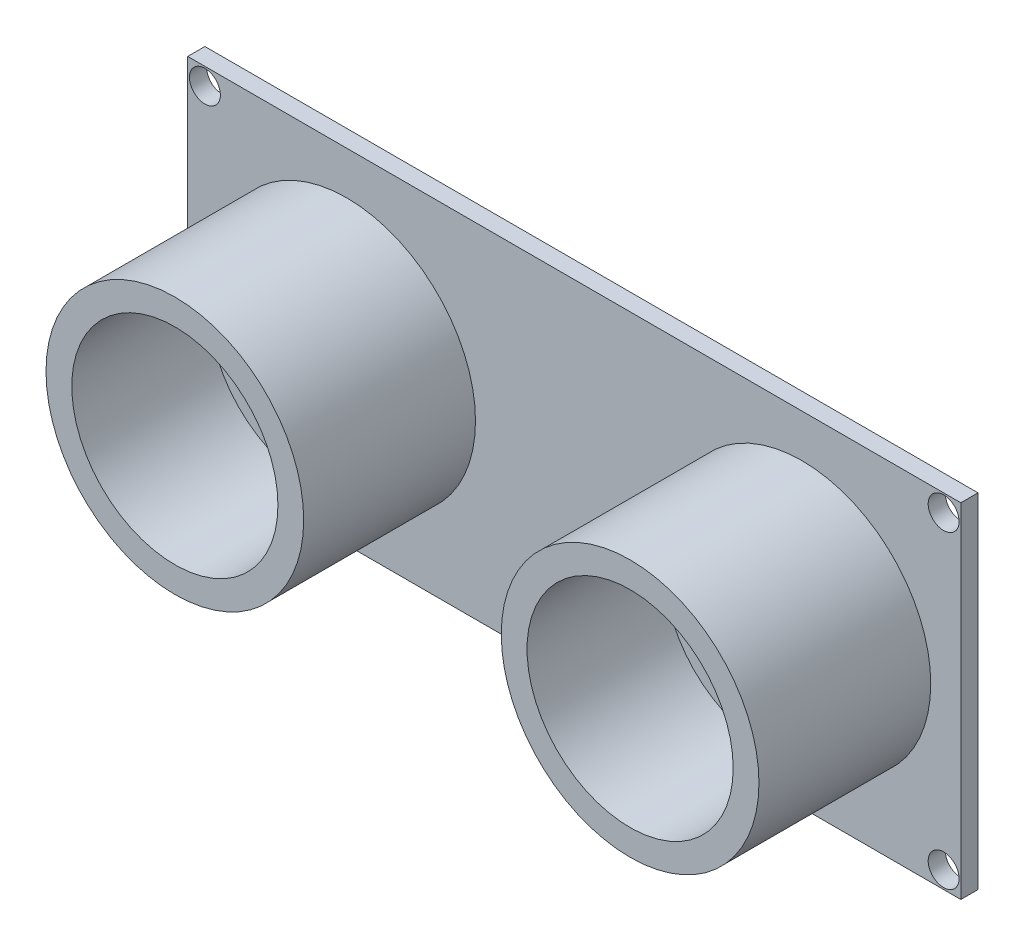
from build123d import *

# Parameters (mm, degrees)
SCHIZZO1_W                   = 45
SCHIZZO1_H                   = 20
ESTRUSIONE_ESTRUSIONE1_DEPTH = 1
FORO_PER_VITE_M1_6_1_D       = 1.8
SCHIZZO4_R                   = 7.5
ESTRUSIONE_ESTRUSIONE2_DEPTH = 10
SCHIZZO5_R                   = 6
TAGLIO_ESTRUSIONE1_DEPTH     = 8
SCHIZZO6_W                   = 0.5
SCHIZZO6_H                   = 7
ESTRUSIONE_ESTRUSIONE3_DEPTH = 0.5


with BuildPart() as part:
    # Schizzo1 → Estrusione-Estrusione1 (new body)
    with BuildSketch(Plane.XY):
        Rectangle(SCHIZZO1_W, SCHIZZO1_H)
    extrude(amount=ESTRUSIONE_ESTRUSIONE1_DEPTH)

    # Foro per Vite M1.6-1 (through all)
    with Locations(Plane.XY.offset(1)):
        with Locations((-21.5, 9), (21.5, 9), (-21.5, -9), (21.5, -9)):
            Hole(FORO_PER_VITE_M1_6_1_D / 2)

    # Schizzo4 → Estrusione-Estrusione2 (add)
    with BuildSketch(Plane.XY.offset(1)):
        with Locations((-13.25, 0)):
            Circle(SCHIZZO4_R)
        with Locations((13.25, 0)):
            Circle(SCHIZZO4_R)
    extrude(amount=ESTRUSIONE_ESTRUSIONE2_DEPTH)

    # Schizzo5 → Taglio-Estrusione1 (cut)
    with BuildSketch(Plane.XY.offset(11)):
        with Locations((-13.25, 0)):
            Circle(SCHIZZO5_R)
        with Locations((13.25, 0)):
            Circle(SCHIZZO5_R)
    extrude(amount=-TAGLIO_ESTRUSIONE1_DEPTH, mode=Mode.SUBTRACT)

    # Schizzo6 → Estrusione-Estrusione3 (add)
    with BuildSketch(Plane(origin=(0, 0, 0), x_dir=(-1, 0, 0), z_dir=(0, 0, -1))):
        with Locations((-2.25, -11.5)):
            Rectangle(SCHIZZO6_W, SCHIZZO6_H)
        with Locations((-0.75, -11.5)):
            Rectangle(SCHIZZO6_W, SCHIZZO6_H)
        with Locations((0.75, -11.5)):
            Rectangle(SCHIZZO6_W, SCHIZZO6_H)
        with Locations((2.25, -11.5)):
            Rectangle(SCHIZZO6_W, SCHIZZO6_H)
    extrude(amount=ESTRUSIONE_ESTRUSIONE3_DEPTH)


solid = part.part
